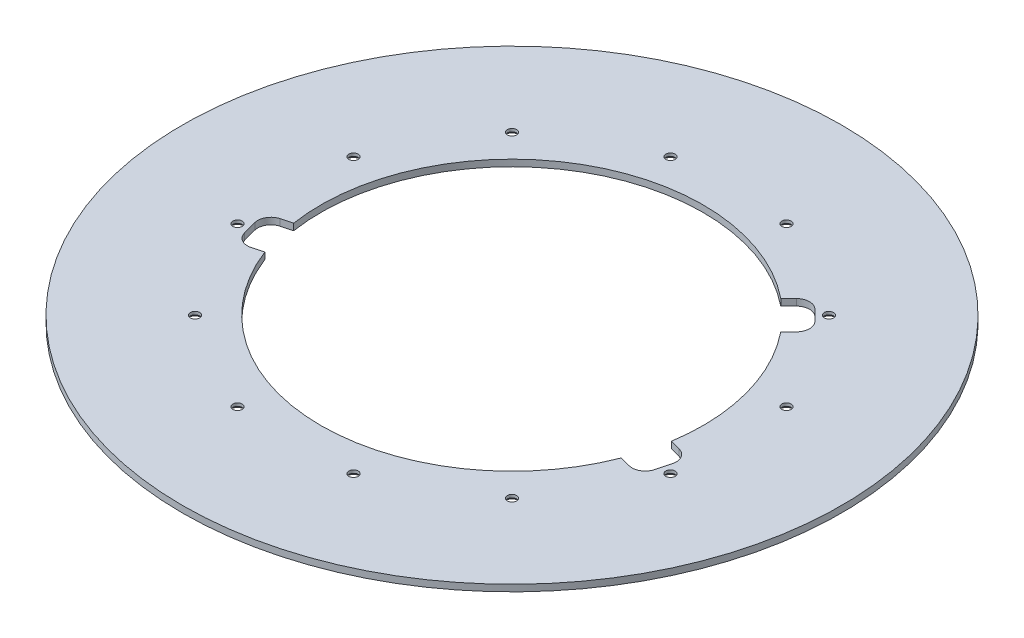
ISO-10303-21;
HEADER;
FILE_DESCRIPTION(('STEP AP214'),'2;1');
FILE_NAME('part.step','',(''),(''),'','','');
FILE_SCHEMA(('AUTOMOTIVE_DESIGN { 1 0 10303 214 1 1 1 1 }'));
ENDSEC;
DATA;
#1=APPLICATION_CONTEXT('core data for automotive mechanical design processes');
#2=APPLICATION_PROTOCOL_DEFINITION('international standard','automotive_design',2000,#1);
#3=PRODUCT_CONTEXT('',#1,'mechanical');
#4=PRODUCT('Part','Part','',(#3));
#5=PRODUCT_RELATED_PRODUCT_CATEGORY('part','',(#4));
#6=PRODUCT_DEFINITION_FORMATION('','',#4);
#7=PRODUCT_DEFINITION_CONTEXT('part definition',#1,'design');
#8=PRODUCT_DEFINITION('design','',#6,#7);
#9=PRODUCT_DEFINITION_SHAPE('','',#8);
#10=(LENGTH_UNIT() NAMED_UNIT(*) SI_UNIT(.MILLI.,.METRE.));
#11=(NAMED_UNIT(*) PLANE_ANGLE_UNIT() SI_UNIT($,.RADIAN.));
#12=(NAMED_UNIT(*) SI_UNIT($,.STERADIAN.) SOLID_ANGLE_UNIT());
#13=UNCERTAINTY_MEASURE_WITH_UNIT(LENGTH_MEASURE(1.E-05),#10,'distance_accuracy_value','');
#14=(GEOMETRIC_REPRESENTATION_CONTEXT(3) GLOBAL_UNCERTAINTY_ASSIGNED_CONTEXT((#13)) GLOBAL_UNIT_ASSIGNED_CONTEXT((#10,
#11,#12)) REPRESENTATION_CONTEXT('',''));
#15=CARTESIAN_POINT('',(0.,0.,0.));
#16=DIRECTION('',(0.,0.,1.));
#17=DIRECTION('',(1.,0.,0.));
#18=AXIS2_PLACEMENT_3D('',#15,#16,#17);
#19=CARTESIAN_POINT('',(0.,0.,0.));
#20=DIRECTION('',(0.,1.,0.));
#21=DIRECTION('',(0.,0.,1.));
#22=AXIS2_PLACEMENT_3D('',#19,#20,#21);
#23=CYLINDRICAL_SURFACE('',#22,92.075);
#24=CARTESIAN_POINT('',(0.,0.,0.));
#25=DIRECTION('',(0.,1.,0.));
#26=DIRECTION('',(0.,0.,1.));
#27=AXIS2_PLACEMENT_3D('',#24,#25,#26);
#28=CIRCLE('',#27,92.075);
#29=CARTESIAN_POINT('',(90.9754475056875,0.,14.1870918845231));
#30=VERTEX_POINT('',#29);
#31=CARTESIAN_POINT('',(71.6935027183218,0.,-57.7741057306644));
#32=VERTEX_POINT('',#31);
#33=EDGE_CURVE('E188',#30,#32,#28,.T.);
#34=ORIENTED_EDGE('',*,*,#33,.F.);
#35=DIRECTION('',(0.,1.,0.));
#36=VECTOR('',#35,1.);
#37=CARTESIAN_POINT('',(90.9754475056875,0.,14.1870918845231));
#38=LINE('',#37,#36);
#39=CARTESIAN_POINT('',(90.9754475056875,3.175,14.1870918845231));
#40=VERTEX_POINT('',#39);
#41=EDGE_CURVE('E11',#30,#40,#38,.T.);
#42=ORIENTED_EDGE('',*,*,#41,.T.);
#43=CARTESIAN_POINT('',(0.,3.175,0.));
#44=DIRECTION('',(0.,1.,0.));
#45=DIRECTION('',(0.,0.,1.));
#46=AXIS2_PLACEMENT_3D('',#43,#44,#45);
#47=CIRCLE('',#46,92.075);
#48=CARTESIAN_POINT('',(71.6935027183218,3.175,-57.7741057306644));
#49=VERTEX_POINT('',#48);
#50=EDGE_CURVE('E400',#40,#49,#47,.T.);
#51=ORIENTED_EDGE('',*,*,#50,.T.);
#52=DIRECTION('',(0.,1.,0.));
#53=VECTOR('',#52,1.);
#54=CARTESIAN_POINT('',(71.6935027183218,0.,-57.7741057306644));
#55=LINE('',#54,#53);
#56=EDGE_CURVE('E412',#49,#32,#55,.F.);
#57=ORIENTED_EDGE('',*,*,#56,.T.);
#58=EDGE_LOOP('',(#34,#42,#51,#57));
#59=FACE_BOUND('',#58,.T.);
#60=ADVANCED_FACE('F40',(#59),#23,.F.);
#61=CARTESIAN_POINT('',(57.7741057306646,0.,-71.6935027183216));
#62=VERTEX_POINT('',#61);
#63=CARTESIAN_POINT('',(-90.9754475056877,0.,14.1870918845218));
#64=VERTEX_POINT('',#63);
#65=EDGE_CURVE('E396',#62,#64,#28,.T.);
#66=ORIENTED_EDGE('',*,*,#65,.F.);
#67=DIRECTION('',(0.,1.,0.));
#68=VECTOR('',#67,1.);
#69=CARTESIAN_POINT('',(57.7741057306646,0.,-71.6935027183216));
#70=LINE('',#69,#68);
#71=CARTESIAN_POINT('',(57.7741057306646,3.175,-71.6935027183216));
#72=VERTEX_POINT('',#71);
#73=EDGE_CURVE('E414',#62,#72,#70,.T.);
#74=ORIENTED_EDGE('',*,*,#73,.T.);
#75=CARTESIAN_POINT('',(-90.9754475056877,3.175,14.1870918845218));
#76=VERTEX_POINT('',#75);
#77=EDGE_CURVE('E391',#72,#76,#47,.T.);
#78=ORIENTED_EDGE('',*,*,#77,.T.);
#79=DIRECTION('',(0.,1.,0.));
#80=VECTOR('',#79,1.);
#81=CARTESIAN_POINT('',(-90.9754475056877,0.,14.1870918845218));
#82=LINE('',#81,#80);
#83=EDGE_CURVE('E404',#76,#64,#82,.F.);
#84=ORIENTED_EDGE('',*,*,#83,.T.);
#85=EDGE_LOOP('',(#66,#74,#78,#84));
#86=FACE_BOUND('',#85,.T.);
#87=ADVANCED_FACE('F459',(#86),#23,.F.);
#88=CARTESIAN_POINT('',(0.,3.175,0.));
#89=DIRECTION('',(0.,-1.,0.));
#90=DIRECTION('',(0.,0.,-1.));
#91=AXIS2_PLACEMENT_3D('',#88,#89,#90);
#92=CYLINDRICAL_SURFACE('',#91,158.75);
#93=CARTESIAN_POINT('',(0.,3.175,0.));
#94=DIRECTION('',(0.,1.,0.));
#95=DIRECTION('',(0.,0.,1.));
#96=AXIS2_PLACEMENT_3D('',#93,#94,#95);
#97=CIRCLE('',#96,158.75);
#98=CARTESIAN_POINT('',(0.,3.175,158.75));
#99=VERTEX_POINT('',#98);
#100=EDGE_CURVE('E401',#99,#99,#97,.T.);
#101=ORIENTED_EDGE('',*,*,#100,.F.);
#102=EDGE_LOOP('',(#101));
#103=FACE_BOUND('',#102,.T.);
#104=CARTESIAN_POINT('',(0.,0.,0.));
#105=DIRECTION('',(0.,1.,0.));
#106=DIRECTION('',(0.,0.,1.));
#107=AXIS2_PLACEMENT_3D('',#104,#105,#106);
#108=CIRCLE('',#107,158.75);
#109=CARTESIAN_POINT('',(0.,0.,158.75));
#110=VERTEX_POINT('',#109);
#111=EDGE_CURVE('E395',#110,#110,#108,.T.);
#112=ORIENTED_EDGE('',*,*,#111,.T.);
#113=EDGE_LOOP('',(#112));
#114=FACE_BOUND('',#113,.T.);
#115=ADVANCED_FACE('F42',(#103,#114),#92,.T.);
#116=CARTESIAN_POINT('',(0.,3.175,0.));
#117=DIRECTION('',(0.,1.,0.));
#118=DIRECTION('',(0.,0.,1.));
#119=AXIS2_PLACEMENT_3D('',#116,#117,#118);
#120=PLANE('',#119);
#121=DIRECTION('',(-0.965925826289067,0.,-0.258819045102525));
#122=VECTOR('',#121,1.);
#123=CARTESIAN_POINT('',(2.54742645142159,3.175,-9.50712494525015));
#124=LINE('',#123,#122);
#125=CARTESIAN_POINT('',(96.0852686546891,3.175,15.5562643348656));
#126=VERTEX_POINT('',#125);
#127=EDGE_CURVE('E216',#126,#40,#124,.T.);
#128=ORIENTED_EDGE('',*,*,#127,.F.);
#129=CARTESIAN_POINT('',(94.4417677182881,3.175,21.6898933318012));
#130=DIRECTION('',(0.,1.,0.));
#131=DIRECTION('',(0.499999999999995,0.,-0.866025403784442));
#132=AXIS2_PLACEMENT_3D('',#129,#130,#131);
#133=CIRCLE('',#132,6.35000000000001);
#134=CARTESIAN_POINT('',(100.575396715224,3.175,23.3333942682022));
#135=VERTEX_POINT('',#134);
#136=EDGE_CURVE('E234',#135,#126,#133,.T.);
#137=ORIENTED_EDGE('',*,*,#136,.F.);
#138=DIRECTION('',(0.258819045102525,0.,-0.965925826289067));
#139=VECTOR('',#138,1.);
#140=CARTESIAN_POINT('',(100.575396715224,3.175,23.3333942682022));
#141=LINE('',#140,#139);
#142=CARTESIAN_POINT('',(98.7675456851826,3.175,30.0803861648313));
#143=VERTEX_POINT('',#142);
#144=EDGE_CURVE('E231',#143,#135,#141,.T.);
#145=ORIENTED_EDGE('',*,*,#144,.F.);
#146=CARTESIAN_POINT('',(92.633916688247,3.175,28.4368852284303));
#147=DIRECTION('',(0.,1.,0.));
#148=DIRECTION('',(-0.499999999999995,0.,0.866025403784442));
#149=AXIS2_PLACEMENT_3D('',#146,#147,#148);
#150=CIRCLE('',#149,6.35);
#151=CARTESIAN_POINT('',(90.9904157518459,3.175,34.5705142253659));
#152=VERTEX_POINT('',#151);
#153=EDGE_CURVE('E228',#152,#143,#150,.T.);
#154=ORIENTED_EDGE('',*,*,#153,.F.);
#155=DIRECTION('',(0.965925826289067,0.,0.258819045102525));
#156=VECTOR('',#155,1.);
#157=CARTESIAN_POINT('',(90.9904157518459,3.175,34.5705142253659));
#158=LINE('',#157,#156);
#159=CARTESIAN_POINT('',(85.8805946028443,3.175,33.2013417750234));
#160=VERTEX_POINT('',#159);
#161=EDGE_CURVE('E210',#160,#152,#158,.T.);
#162=ORIENTED_EDGE('',*,*,#161,.F.);
#163=CARTESIAN_POINT('',(-85.8805946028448,3.175,33.2013417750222));
#164=VERTEX_POINT('',#163);
#165=EDGE_CURVE('E397',#164,#160,#47,.T.);
#166=ORIENTED_EDGE('',*,*,#165,.F.);
#167=DIRECTION('',(0.965925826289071,0.,-0.258819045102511));
#168=VECTOR('',#167,1.);
#169=CARTESIAN_POINT('',(2.54742645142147,3.175,9.50712494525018));
#170=LINE('',#169,#168);
#171=CARTESIAN_POINT('',(-90.9904157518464,3.175,34.5705142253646));
#172=VERTEX_POINT('',#171);
#173=EDGE_CURVE('E251',#172,#164,#170,.T.);
#174=ORIENTED_EDGE('',*,*,#173,.F.);
#175=CARTESIAN_POINT('',(-92.6339166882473,3.175,28.436885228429));
#176=DIRECTION('',(0.,1.,0.));
#177=DIRECTION('',(0.,0.,1.));
#178=AXIS2_PLACEMENT_3D('',#175,#176,#177);
#179=CIRCLE('',#178,6.35000000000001);
#180=CARTESIAN_POINT('',(-98.767545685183,3.175,30.08038616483));
#181=VERTEX_POINT('',#180);
#182=EDGE_CURVE('E271',#181,#172,#179,.T.);
#183=ORIENTED_EDGE('',*,*,#182,.F.);
#184=DIRECTION('',(0.258819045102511,0.,0.965925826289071));
#185=VECTOR('',#184,1.);
#186=CARTESIAN_POINT('',(-98.767545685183,3.175,30.08038616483));
#187=LINE('',#186,#185);
#188=CARTESIAN_POINT('',(-100.575396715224,3.175,23.3333942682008));
#189=VERTEX_POINT('',#188);
#190=EDGE_CURVE('E268',#189,#181,#187,.T.);
#191=ORIENTED_EDGE('',*,*,#190,.F.);
#192=CARTESIAN_POINT('',(-94.4417677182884,3.175,21.6898933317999));
#193=DIRECTION('',(0.,1.,0.));
#194=DIRECTION('',(0.,0.,-1.));
#195=AXIS2_PLACEMENT_3D('',#192,#193,#194);
#196=CIRCLE('',#195,6.35);
#197=CARTESIAN_POINT('',(-96.0852686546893,3.175,15.5562643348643));
#198=VERTEX_POINT('',#197);
#199=EDGE_CURVE('E265',#198,#189,#196,.T.);
#200=ORIENTED_EDGE('',*,*,#199,.F.);
#201=DIRECTION('',(-0.965925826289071,0.,0.258819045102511));
#202=VECTOR('',#201,1.);
#203=CARTESIAN_POINT('',(-96.0852686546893,3.175,15.5562643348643));
#204=LINE('',#203,#202);
#205=EDGE_CURVE('E240',#76,#198,#204,.T.);
#206=ORIENTED_EDGE('',*,*,#205,.F.);
#207=ORIENTED_EDGE('',*,*,#77,.F.);
#208=DIRECTION('',(-0.707106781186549,0.,0.707106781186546));
#209=VECTOR('',#208,1.);
#210=CARTESIAN_POINT('',(-6.95969849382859,3.175,-6.9596984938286));
#211=LINE('',#210,#209);
#212=CARTESIAN_POINT('',(61.5147544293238,3.175,-75.4341514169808));
#213=VERTEX_POINT('',#212);
#214=EDGE_CURVE('E189',#213,#72,#211,.T.);
#215=ORIENTED_EDGE('',*,*,#214,.F.);
#216=CARTESIAN_POINT('',(66.0048824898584,3.175,-70.9440233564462));
#217=DIRECTION('',(0.,1.,0.));
#218=DIRECTION('',(-0.500000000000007,0.,-0.866025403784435));
#219=AXIS2_PLACEMENT_3D('',#216,#217,#218);
#220=CIRCLE('',#219,6.35000000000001);
#221=CARTESIAN_POINT('',(70.495010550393,3.175,-75.4341514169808));
#222=VERTEX_POINT('',#221);
#223=EDGE_CURVE('E191',#222,#213,#220,.T.);
#224=ORIENTED_EDGE('',*,*,#223,.F.);
#225=DIRECTION('',(-0.707106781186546,0.,-0.707106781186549));
#226=VECTOR('',#225,1.);
#227=CARTESIAN_POINT('',(70.495010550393,3.175,-75.4341514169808));
#228=LINE('',#227,#226);
#229=CARTESIAN_POINT('',(75.434151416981,3.175,-70.4950105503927));
#230=VERTEX_POINT('',#229);
#231=EDGE_CURVE('E203',#230,#222,#228,.T.);
#232=ORIENTED_EDGE('',*,*,#231,.F.);
#233=CARTESIAN_POINT('',(70.9440233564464,3.175,-66.0048824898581));
#234=DIRECTION('',(0.,1.,0.));
#235=DIRECTION('',(0.500000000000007,0.,0.866025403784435));
#236=AXIS2_PLACEMENT_3D('',#233,#234,#235);
#237=CIRCLE('',#236,6.35);
#238=CARTESIAN_POINT('',(75.434151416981,3.175,-61.5147544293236));
#239=VERTEX_POINT('',#238);
#240=EDGE_CURVE('E201',#239,#230,#237,.T.);
#241=ORIENTED_EDGE('',*,*,#240,.F.);
#242=DIRECTION('',(0.707106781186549,0.,-0.707106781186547));
#243=VECTOR('',#242,1.);
#244=CARTESIAN_POINT('',(75.434151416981,3.175,-61.5147544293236));
#245=LINE('',#244,#243);
#246=EDGE_CURVE('E167',#49,#239,#245,.T.);
#247=ORIENTED_EDGE('',*,*,#246,.F.);
#248=ORIENTED_EDGE('',*,*,#50,.F.);
#249=EDGE_LOOP('',(#128,#137,#145,#154,#162,#166,#174,#183,#191,#200,#206,#207,#215,#224,#232,
#241,#247,#248));
#250=FACE_BOUND('',#249,.T.);
#251=CARTESIAN_POINT('',(-76.3321770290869,3.175,-76.3321770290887));
#252=DIRECTION('',(0.,-1.,0.));
#253=DIRECTION('',(0.,0.,-1.));
#254=AXIS2_PLACEMENT_3D('',#251,#252,#253);
#255=CIRCLE('',#254,2.25);
#256=CARTESIAN_POINT('',(-76.3321770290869,3.175,-78.5821770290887));
#257=VERTEX_POINT('',#256);
#258=EDGE_CURVE('E289',#257,#257,#255,.T.);
#259=ORIENTED_EDGE('',*,*,#258,.T.);
#260=EDGE_LOOP('',(#259));
#261=FACE_BOUND('',#260,.T.);
#262=CARTESIAN_POINT('',(-104.271692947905,3.175,-27.9395159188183));
#263=DIRECTION('',(0.,-1.,0.));
#264=DIRECTION('',(0.,0.,-1.));
#265=AXIS2_PLACEMENT_3D('',#262,#263,#264);
#266=CIRCLE('',#265,2.25);
#267=CARTESIAN_POINT('',(-104.271692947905,3.175,-30.1895159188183));
#268=VERTEX_POINT('',#267);
#269=EDGE_CURVE('E298',#268,#268,#266,.T.);
#270=ORIENTED_EDGE('',*,*,#269,.T.);
#271=EDGE_LOOP('',(#270));
#272=FACE_BOUND('',#271,.T.);
#273=CARTESIAN_POINT('',(-104.271692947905,3.175,27.9395159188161));
#274=DIRECTION('',(0.,-1.,0.));
#275=DIRECTION('',(0.,0.,-1.));
#276=AXIS2_PLACEMENT_3D('',#273,#274,#275);
#277=CIRCLE('',#276,2.25);
#278=CARTESIAN_POINT('',(-104.271692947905,3.175,25.6895159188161));
#279=VERTEX_POINT('',#278);
#280=EDGE_CURVE('E307',#279,#279,#277,.T.);
#281=ORIENTED_EDGE('',*,*,#280,.T.);
#282=EDGE_LOOP('',(#281));
#283=FACE_BOUND('',#282,.T.);
#284=CARTESIAN_POINT('',(-76.3321770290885,3.175,76.3321770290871));
#285=DIRECTION('',(0.,-1.,0.));
#286=DIRECTION('',(0.,0.,-1.));
#287=AXIS2_PLACEMENT_3D('',#284,#285,#286);
#288=CIRCLE('',#287,2.25);
#289=CARTESIAN_POINT('',(-76.3321770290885,3.175,74.0821770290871));
#290=VERTEX_POINT('',#289);
#291=EDGE_CURVE('E316',#290,#290,#288,.T.);
#292=ORIENTED_EDGE('',*,*,#291,.T.);
#293=EDGE_LOOP('',(#292));
#294=FACE_BOUND('',#293,.T.);
#295=CARTESIAN_POINT('',(-27.9395159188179,3.175,104.271692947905));
#296=DIRECTION('',(0.,-1.,0.));
#297=DIRECTION('',(0.,0.,-1.));
#298=AXIS2_PLACEMENT_3D('',#295,#296,#297);
#299=CIRCLE('',#298,2.25);
#300=CARTESIAN_POINT('',(-27.9395159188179,3.175,102.021692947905));
#301=VERTEX_POINT('',#300);
#302=EDGE_CURVE('E325',#301,#301,#299,.T.);
#303=ORIENTED_EDGE('',*,*,#302,.T.);
#304=EDGE_LOOP('',(#303));
#305=FACE_BOUND('',#304,.T.);
#306=CARTESIAN_POINT('',(27.9395159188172,3.175,104.271692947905));
#307=DIRECTION('',(0.,-1.,0.));
#308=DIRECTION('',(0.,0.,-1.));
#309=AXIS2_PLACEMENT_3D('',#306,#307,#308);
#310=CIRCLE('',#309,2.25);
#311=CARTESIAN_POINT('',(27.9395159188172,3.175,102.021692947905));
#312=VERTEX_POINT('',#311);
#313=EDGE_CURVE('E334',#312,#312,#310,.T.);
#314=ORIENTED_EDGE('',*,*,#313,.T.);
#315=EDGE_LOOP('',(#314));
#316=FACE_BOUND('',#315,.T.);
#317=CARTESIAN_POINT('',(76.3321770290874,3.175,76.3321770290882));
#318=DIRECTION('',(0.,-1.,0.));
#319=DIRECTION('',(0.,0.,-1.));
#320=AXIS2_PLACEMENT_3D('',#317,#318,#319);
#321=CIRCLE('',#320,2.25);
#322=CARTESIAN_POINT('',(76.3321770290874,3.175,74.0821770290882));
#323=VERTEX_POINT('',#322);
#324=EDGE_CURVE('E343',#323,#323,#321,.T.);
#325=ORIENTED_EDGE('',*,*,#324,.T.);
#326=EDGE_LOOP('',(#325));
#327=FACE_BOUND('',#326,.T.);
#328=CARTESIAN_POINT('',(104.271692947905,3.175,27.9395159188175));
#329=DIRECTION('',(0.,-1.,0.));
#330=DIRECTION('',(0.,0.,-1.));
#331=AXIS2_PLACEMENT_3D('',#328,#329,#330);
#332=CIRCLE('',#331,2.25);
#333=CARTESIAN_POINT('',(104.271692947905,3.175,25.6895159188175));
#334=VERTEX_POINT('',#333);
#335=EDGE_CURVE('E352',#334,#334,#332,.T.);
#336=ORIENTED_EDGE('',*,*,#335,.T.);
#337=EDGE_LOOP('',(#336));
#338=FACE_BOUND('',#337,.T.);
#339=CARTESIAN_POINT('',(104.271692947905,3.175,-27.9395159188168));
#340=DIRECTION('',(0.,-1.,0.));
#341=DIRECTION('',(0.,0.,-1.));
#342=AXIS2_PLACEMENT_3D('',#339,#340,#341);
#343=CIRCLE('',#342,2.25);
#344=CARTESIAN_POINT('',(104.271692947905,3.175,-30.1895159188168));
#345=VERTEX_POINT('',#344);
#346=EDGE_CURVE('E361',#345,#345,#343,.T.);
#347=ORIENTED_EDGE('',*,*,#346,.T.);
#348=EDGE_LOOP('',(#347));
#349=FACE_BOUND('',#348,.T.);
#350=CARTESIAN_POINT('',(76.3321770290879,3.175,-76.3321770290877));
#351=DIRECTION('',(0.,-1.,0.));
#352=DIRECTION('',(0.,0.,-1.));
#353=AXIS2_PLACEMENT_3D('',#350,#351,#352);
#354=CIRCLE('',#353,2.25);
#355=CARTESIAN_POINT('',(76.3321770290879,3.175,-78.5821770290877));
#356=VERTEX_POINT('',#355);
#357=EDGE_CURVE('E370',#356,#356,#354,.T.);
#358=ORIENTED_EDGE('',*,*,#357,.T.);
#359=EDGE_LOOP('',(#358));
#360=FACE_BOUND('',#359,.T.);
#361=CARTESIAN_POINT('',(27.9395159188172,3.175,-104.271692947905));
#362=DIRECTION('',(0.,-1.,0.));
#363=DIRECTION('',(0.,0.,-1.));
#364=AXIS2_PLACEMENT_3D('',#361,#362,#363);
#365=CIRCLE('',#364,2.25);
#366=CARTESIAN_POINT('',(27.9395159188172,3.175,-106.521692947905));
#367=VERTEX_POINT('',#366);
#368=EDGE_CURVE('E379',#367,#367,#365,.T.);
#369=ORIENTED_EDGE('',*,*,#368,.T.);
#370=EDGE_LOOP('',(#369));
#371=FACE_BOUND('',#370,.T.);
#372=CARTESIAN_POINT('',(-27.9395159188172,3.175,-104.271692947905));
#373=DIRECTION('',(0.,-1.,0.));
#374=DIRECTION('',(0.,0.,-1.));
#375=AXIS2_PLACEMENT_3D('',#372,#373,#374);
#376=CIRCLE('',#375,2.25);
#377=CARTESIAN_POINT('',(-27.9395159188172,3.175,-106.521692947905));
#378=VERTEX_POINT('',#377);
#379=EDGE_CURVE('E388',#378,#378,#376,.T.);
#380=ORIENTED_EDGE('',*,*,#379,.T.);
#381=EDGE_LOOP('',(#380));
#382=FACE_BOUND('',#381,.T.);
#383=ORIENTED_EDGE('',*,*,#100,.T.);
#384=EDGE_LOOP('',(#383));
#385=FACE_BOUND('',#384,.T.);
#386=ADVANCED_FACE('F428',(#250,#261,#272,#283,#294,#305,#316,#327,#338,#349,#360,#371,#382,
#385),#120,.T.);
#387=CARTESIAN_POINT('',(0.,0.,0.));
#388=DIRECTION('',(0.,1.,0.));
#389=DIRECTION('',(0.,0.,1.));
#390=AXIS2_PLACEMENT_3D('',#387,#388,#389);
#391=PLANE('',#390);
#392=CARTESIAN_POINT('',(-76.3321770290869,0.,-76.3321770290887));
#393=DIRECTION('',(0.,-1.,0.));
#394=DIRECTION('',(0.,0.,-1.));
#395=AXIS2_PLACEMENT_3D('',#392,#393,#394);
#396=CIRCLE('',#395,4.0005);
#397=CARTESIAN_POINT('',(-76.3321770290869,0.,-80.3326770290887));
#398=VERTEX_POINT('',#397);
#399=EDGE_CURVE('E277',#398,#398,#396,.T.);
#400=ORIENTED_EDGE('',*,*,#399,.F.);
#401=EDGE_LOOP('',(#400));
#402=FACE_BOUND('',#401,.T.);
#403=CARTESIAN_POINT('',(-104.271692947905,0.,-27.9395159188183));
#404=DIRECTION('',(0.,-1.,0.));
#405=DIRECTION('',(0.,0.,-1.));
#406=AXIS2_PLACEMENT_3D('',#403,#404,#405);
#407=CIRCLE('',#406,4.0005);
#408=CARTESIAN_POINT('',(-104.271692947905,0.,-31.9400159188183));
#409=VERTEX_POINT('',#408);
#410=EDGE_CURVE('E292',#409,#409,#407,.T.);
#411=ORIENTED_EDGE('',*,*,#410,.F.);
#412=EDGE_LOOP('',(#411));
#413=FACE_BOUND('',#412,.T.);
#414=CARTESIAN_POINT('',(-104.271692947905,0.,27.9395159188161));
#415=DIRECTION('',(0.,-1.,0.));
#416=DIRECTION('',(0.,0.,-1.));
#417=AXIS2_PLACEMENT_3D('',#414,#415,#416);
#418=CIRCLE('',#417,4.0005);
#419=CARTESIAN_POINT('',(-104.271692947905,0.,23.9390159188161));
#420=VERTEX_POINT('',#419);
#421=EDGE_CURVE('E301',#420,#420,#418,.T.);
#422=ORIENTED_EDGE('',*,*,#421,.F.);
#423=EDGE_LOOP('',(#422));
#424=FACE_BOUND('',#423,.T.);
#425=CARTESIAN_POINT('',(-76.3321770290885,0.,76.3321770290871));
#426=DIRECTION('',(0.,-1.,0.));
#427=DIRECTION('',(0.,0.,-1.));
#428=AXIS2_PLACEMENT_3D('',#425,#426,#427);
#429=CIRCLE('',#428,4.0005);
#430=CARTESIAN_POINT('',(-76.3321770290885,0.,72.3316770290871));
#431=VERTEX_POINT('',#430);
#432=EDGE_CURVE('E310',#431,#431,#429,.T.);
#433=ORIENTED_EDGE('',*,*,#432,.F.);
#434=EDGE_LOOP('',(#433));
#435=FACE_BOUND('',#434,.T.);
#436=CARTESIAN_POINT('',(-27.9395159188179,0.,104.271692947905));
#437=DIRECTION('',(0.,-1.,0.));
#438=DIRECTION('',(0.,0.,-1.));
#439=AXIS2_PLACEMENT_3D('',#436,#437,#438);
#440=CIRCLE('',#439,4.0005);
#441=CARTESIAN_POINT('',(-27.9395159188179,0.,100.271192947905));
#442=VERTEX_POINT('',#441);
#443=EDGE_CURVE('E319',#442,#442,#440,.T.);
#444=ORIENTED_EDGE('',*,*,#443,.F.);
#445=EDGE_LOOP('',(#444));
#446=FACE_BOUND('',#445,.T.);
#447=CARTESIAN_POINT('',(27.9395159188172,0.,104.271692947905));
#448=DIRECTION('',(0.,-1.,0.));
#449=DIRECTION('',(0.,0.,-1.));
#450=AXIS2_PLACEMENT_3D('',#447,#448,#449);
#451=CIRCLE('',#450,4.0005);
#452=CARTESIAN_POINT('',(27.9395159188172,0.,100.271192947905));
#453=VERTEX_POINT('',#452);
#454=EDGE_CURVE('E328',#453,#453,#451,.T.);
#455=ORIENTED_EDGE('',*,*,#454,.F.);
#456=EDGE_LOOP('',(#455));
#457=FACE_BOUND('',#456,.T.);
#458=CARTESIAN_POINT('',(76.3321770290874,0.,76.3321770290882));
#459=DIRECTION('',(0.,-1.,0.));
#460=DIRECTION('',(0.,0.,-1.));
#461=AXIS2_PLACEMENT_3D('',#458,#459,#460);
#462=CIRCLE('',#461,4.0005);
#463=CARTESIAN_POINT('',(76.3321770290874,0.,72.3316770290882));
#464=VERTEX_POINT('',#463);
#465=EDGE_CURVE('E337',#464,#464,#462,.T.);
#466=ORIENTED_EDGE('',*,*,#465,.F.);
#467=EDGE_LOOP('',(#466));
#468=FACE_BOUND('',#467,.T.);
#469=CARTESIAN_POINT('',(104.271692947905,0.,27.9395159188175));
#470=DIRECTION('',(0.,-1.,0.));
#471=DIRECTION('',(0.,0.,-1.));
#472=AXIS2_PLACEMENT_3D('',#469,#470,#471);
#473=CIRCLE('',#472,4.0005);
#474=CARTESIAN_POINT('',(104.271692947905,0.,23.9390159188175));
#475=VERTEX_POINT('',#474);
#476=EDGE_CURVE('E346',#475,#475,#473,.T.);
#477=ORIENTED_EDGE('',*,*,#476,.F.);
#478=EDGE_LOOP('',(#477));
#479=FACE_BOUND('',#478,.T.);
#480=CARTESIAN_POINT('',(104.271692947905,0.,-27.9395159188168));
#481=DIRECTION('',(0.,-1.,0.));
#482=DIRECTION('',(0.,0.,-1.));
#483=AXIS2_PLACEMENT_3D('',#480,#481,#482);
#484=CIRCLE('',#483,4.0005);
#485=CARTESIAN_POINT('',(104.271692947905,0.,-31.9400159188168));
#486=VERTEX_POINT('',#485);
#487=EDGE_CURVE('E355',#486,#486,#484,.T.);
#488=ORIENTED_EDGE('',*,*,#487,.F.);
#489=EDGE_LOOP('',(#488));
#490=FACE_BOUND('',#489,.T.);
#491=CARTESIAN_POINT('',(76.3321770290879,0.,-76.3321770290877));
#492=DIRECTION('',(0.,-1.,0.));
#493=DIRECTION('',(0.,0.,-1.));
#494=AXIS2_PLACEMENT_3D('',#491,#492,#493);
#495=CIRCLE('',#494,4.0005);
#496=CARTESIAN_POINT('',(76.3321770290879,0.,-80.3326770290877));
#497=VERTEX_POINT('',#496);
#498=EDGE_CURVE('E364',#497,#497,#495,.T.);
#499=ORIENTED_EDGE('',*,*,#498,.F.);
#500=EDGE_LOOP('',(#499));
#501=FACE_BOUND('',#500,.T.);
#502=CARTESIAN_POINT('',(27.9395159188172,0.,-104.271692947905));
#503=DIRECTION('',(0.,-1.,0.));
#504=DIRECTION('',(0.,0.,-1.));
#505=AXIS2_PLACEMENT_3D('',#502,#503,#504);
#506=CIRCLE('',#505,4.0005);
#507=CARTESIAN_POINT('',(27.9395159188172,0.,-108.272192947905));
#508=VERTEX_POINT('',#507);
#509=EDGE_CURVE('E373',#508,#508,#506,.T.);
#510=ORIENTED_EDGE('',*,*,#509,.F.);
#511=EDGE_LOOP('',(#510));
#512=FACE_BOUND('',#511,.T.);
#513=CARTESIAN_POINT('',(-27.9395159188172,0.,-104.271692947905));
#514=DIRECTION('',(0.,-1.,0.));
#515=DIRECTION('',(0.,0.,-1.));
#516=AXIS2_PLACEMENT_3D('',#513,#514,#515);
#517=CIRCLE('',#516,4.0005);
#518=CARTESIAN_POINT('',(-27.9395159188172,0.,-108.272192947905));
#519=VERTEX_POINT('',#518);
#520=EDGE_CURVE('E382',#519,#519,#517,.T.);
#521=ORIENTED_EDGE('',*,*,#520,.F.);
#522=EDGE_LOOP('',(#521));
#523=FACE_BOUND('',#522,.T.);
#524=CARTESIAN_POINT('',(94.4417677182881,0.,21.6898933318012));
#525=DIRECTION('',(0.,1.,0.));
#526=DIRECTION('',(0.499999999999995,0.,-0.866025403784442));
#527=AXIS2_PLACEMENT_3D('',#524,#525,#526);
#528=CIRCLE('',#527,6.35000000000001);
#529=CARTESIAN_POINT('',(100.575396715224,0.,23.3333942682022));
#530=VERTEX_POINT('',#529);
#531=CARTESIAN_POINT('',(96.0852686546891,0.,15.5562643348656));
#532=VERTEX_POINT('',#531);
#533=EDGE_CURVE('E222',#530,#532,#528,.T.);
#534=ORIENTED_EDGE('',*,*,#533,.T.);
#535=DIRECTION('',(-0.965925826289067,0.,-0.258819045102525));
#536=VECTOR('',#535,1.);
#537=CARTESIAN_POINT('',(2.54742645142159,0.,-9.50712494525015));
#538=LINE('',#537,#536);
#539=EDGE_CURVE('E224',#532,#30,#538,.T.);
#540=ORIENTED_EDGE('',*,*,#539,.T.);
#541=ORIENTED_EDGE('',*,*,#33,.T.);
#542=DIRECTION('',(0.707106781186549,0.,-0.707106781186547));
#543=VECTOR('',#542,1.);
#544=CARTESIAN_POINT('',(75.434151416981,0.,-61.5147544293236));
#545=LINE('',#544,#543);
#546=CARTESIAN_POINT('',(75.434151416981,0.,-61.5147544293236));
#547=VERTEX_POINT('',#546);
#548=EDGE_CURVE('E55',#32,#547,#545,.T.);
#549=ORIENTED_EDGE('',*,*,#548,.T.);
#550=CARTESIAN_POINT('',(70.9440233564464,0.,-66.0048824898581));
#551=DIRECTION('',(0.,1.,0.));
#552=DIRECTION('',(0.500000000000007,0.,0.866025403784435));
#553=AXIS2_PLACEMENT_3D('',#550,#551,#552);
#554=CIRCLE('',#553,6.35);
#555=CARTESIAN_POINT('',(75.434151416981,0.,-70.4950105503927));
#556=VERTEX_POINT('',#555);
#557=EDGE_CURVE('E175',#547,#556,#554,.T.);
#558=ORIENTED_EDGE('',*,*,#557,.T.);
#559=DIRECTION('',(-0.707106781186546,0.,-0.707106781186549));
#560=VECTOR('',#559,1.);
#561=CARTESIAN_POINT('',(70.495010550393,0.,-75.4341514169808));
#562=LINE('',#561,#560);
#563=CARTESIAN_POINT('',(70.495010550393,0.,-75.4341514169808));
#564=VERTEX_POINT('',#563);
#565=EDGE_CURVE('E180',#556,#564,#562,.T.);
#566=ORIENTED_EDGE('',*,*,#565,.T.);
#567=CARTESIAN_POINT('',(66.0048824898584,0.,-70.9440233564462));
#568=DIRECTION('',(0.,1.,0.));
#569=DIRECTION('',(-0.500000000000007,0.,-0.866025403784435));
#570=AXIS2_PLACEMENT_3D('',#567,#568,#569);
#571=CIRCLE('',#570,6.35000000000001);
#572=CARTESIAN_POINT('',(61.5147544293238,0.,-75.4341514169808));
#573=VERTEX_POINT('',#572);
#574=EDGE_CURVE('E195',#564,#573,#571,.T.);
#575=ORIENTED_EDGE('',*,*,#574,.T.);
#576=DIRECTION('',(-0.707106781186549,0.,0.707106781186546));
#577=VECTOR('',#576,1.);
#578=CARTESIAN_POINT('',(-6.95969849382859,0.,-6.9596984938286));
#579=LINE('',#578,#577);
#580=EDGE_CURVE('E172',#573,#62,#579,.T.);
#581=ORIENTED_EDGE('',*,*,#580,.T.);
#582=ORIENTED_EDGE('',*,*,#65,.T.);
#583=DIRECTION('',(-0.965925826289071,0.,0.258819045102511));
#584=VECTOR('',#583,1.);
#585=CARTESIAN_POINT('',(-96.0852686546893,0.,15.5562643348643));
#586=LINE('',#585,#584);
#587=CARTESIAN_POINT('',(-96.0852686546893,0.,15.5562643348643));
#588=VERTEX_POINT('',#587);
#589=EDGE_CURVE('E247',#64,#588,#586,.T.);
#590=ORIENTED_EDGE('',*,*,#589,.T.);
#591=CARTESIAN_POINT('',(-94.4417677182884,0.,21.6898933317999));
#592=DIRECTION('',(0.,1.,0.));
#593=DIRECTION('',(0.,0.,-1.));
#594=AXIS2_PLACEMENT_3D('',#591,#592,#593);
#595=CIRCLE('',#594,6.35);
#596=CARTESIAN_POINT('',(-100.575396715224,0.,23.3333942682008));
#597=VERTEX_POINT('',#596);
#598=EDGE_CURVE('E250',#588,#597,#595,.T.);
#599=ORIENTED_EDGE('',*,*,#598,.T.);
#600=DIRECTION('',(0.258819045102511,0.,0.965925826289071));
#601=VECTOR('',#600,1.);
#602=CARTESIAN_POINT('',(-98.767545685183,0.,30.08038616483));
#603=LINE('',#602,#601);
#604=CARTESIAN_POINT('',(-98.767545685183,0.,30.08038616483));
#605=VERTEX_POINT('',#604);
#606=EDGE_CURVE('E254',#597,#605,#603,.T.);
#607=ORIENTED_EDGE('',*,*,#606,.T.);
#608=CARTESIAN_POINT('',(-92.6339166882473,0.,28.436885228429));
#609=DIRECTION('',(0.,1.,0.));
#610=DIRECTION('',(0.,0.,1.));
#611=AXIS2_PLACEMENT_3D('',#608,#609,#610);
#612=CIRCLE('',#611,6.35000000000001);
#613=CARTESIAN_POINT('',(-90.9904157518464,0.,34.5705142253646));
#614=VERTEX_POINT('',#613);
#615=EDGE_CURVE('E257',#605,#614,#612,.T.);
#616=ORIENTED_EDGE('',*,*,#615,.T.);
#617=DIRECTION('',(0.965925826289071,0.,-0.258819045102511));
#618=VECTOR('',#617,1.);
#619=CARTESIAN_POINT('',(2.54742645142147,0.,9.50712494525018));
#620=LINE('',#619,#618);
#621=CARTESIAN_POINT('',(-85.8805946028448,0.,33.2013417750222));
#622=VERTEX_POINT('',#621);
#623=EDGE_CURVE('E260',#614,#622,#620,.T.);
#624=ORIENTED_EDGE('',*,*,#623,.T.);
#625=CARTESIAN_POINT('',(85.8805946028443,0.,33.2013417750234));
#626=VERTEX_POINT('',#625);
#627=EDGE_CURVE('E392',#622,#626,#28,.T.);
#628=ORIENTED_EDGE('',*,*,#627,.T.);
#629=DIRECTION('',(0.965925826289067,0.,0.258819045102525));
#630=VECTOR('',#629,1.);
#631=CARTESIAN_POINT('',(90.9904157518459,0.,34.5705142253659));
#632=LINE('',#631,#630);
#633=CARTESIAN_POINT('',(90.9904157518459,0.,34.5705142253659));
#634=VERTEX_POINT('',#633);
#635=EDGE_CURVE('E63',#626,#634,#632,.T.);
#636=ORIENTED_EDGE('',*,*,#635,.T.);
#637=CARTESIAN_POINT('',(92.633916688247,0.,28.4368852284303));
#638=DIRECTION('',(0.,1.,0.));
#639=DIRECTION('',(-0.499999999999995,0.,0.866025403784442));
#640=AXIS2_PLACEMENT_3D('',#637,#638,#639);
#641=CIRCLE('',#640,6.35);
#642=CARTESIAN_POINT('',(98.7675456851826,0.,30.0803861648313));
#643=VERTEX_POINT('',#642);
#644=EDGE_CURVE('E215',#634,#643,#641,.T.);
#645=ORIENTED_EDGE('',*,*,#644,.T.);
#646=DIRECTION('',(0.258819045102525,0.,-0.965925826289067));
#647=VECTOR('',#646,1.);
#648=CARTESIAN_POINT('',(100.575396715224,0.,23.3333942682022));
#649=LINE('',#648,#647);
#650=EDGE_CURVE('E219',#643,#530,#649,.T.);
#651=ORIENTED_EDGE('',*,*,#650,.T.);
#652=EDGE_LOOP('',(#534,#540,#541,#549,#558,#566,#575,#581,#582,#590,#599,#607,#616,#624,#628,
#636,#645,#651));
#653=FACE_BOUND('',#652,.T.);
#654=ORIENTED_EDGE('',*,*,#111,.F.);
#655=EDGE_LOOP('',(#654));
#656=FACE_BOUND('',#655,.T.);
#657=ADVANCED_FACE('F184',(#402,#413,#424,#435,#446,#457,#468,#479,#490,#501,#512,#523,#653,
#656),#391,.F.);
#658=ORIENTED_EDGE('',*,*,#165,.T.);
#659=DIRECTION('',(0.,1.,0.));
#660=VECTOR('',#659,1.);
#661=CARTESIAN_POINT('',(85.8805946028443,0.,33.2013417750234));
#662=LINE('',#661,#660);
#663=EDGE_CURVE('E48',#160,#626,#662,.F.);
#664=ORIENTED_EDGE('',*,*,#663,.T.);
#665=ORIENTED_EDGE('',*,*,#627,.F.);
#666=DIRECTION('',(0.,1.,0.));
#667=VECTOR('',#666,1.);
#668=CARTESIAN_POINT('',(-85.8805946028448,0.,33.2013417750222));
#669=LINE('',#668,#667);
#670=EDGE_CURVE('E409',#622,#164,#669,.T.);
#671=ORIENTED_EDGE('',*,*,#670,.T.);
#672=EDGE_LOOP('',(#658,#664,#665,#671));
#673=FACE_BOUND('',#672,.T.);
#674=ADVANCED_FACE('F418',(#673),#23,.F.);
#675=CARTESIAN_POINT('',(-27.9395159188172,0.,-104.271692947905));
#676=DIRECTION('',(0.,-1.,0.));
#677=DIRECTION('',(0.,0.,-1.));
#678=AXIS2_PLACEMENT_3D('',#675,#676,#677);
#679=CYLINDRICAL_SURFACE('',#678,2.25);
#680=ORIENTED_EDGE('',*,*,#379,.F.);
#681=EDGE_LOOP('',(#680));
#682=FACE_BOUND('',#681,.T.);
#683=CARTESIAN_POINT('',(-27.9395159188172,1.7505,-104.271692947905));
#684=DIRECTION('',(0.,-1.,0.));
#685=DIRECTION('',(0.,0.,-1.));
#686=AXIS2_PLACEMENT_3D('',#683,#684,#685);
#687=CIRCLE('',#686,2.25);
#688=CARTESIAN_POINT('',(-27.9395159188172,1.7505,-106.521692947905));
#689=VERTEX_POINT('',#688);
#690=EDGE_CURVE('E385',#689,#689,#687,.T.);
#691=ORIENTED_EDGE('',*,*,#690,.T.);
#692=EDGE_LOOP('',(#691));
#693=FACE_BOUND('',#692,.T.);
#694=ADVANCED_FACE('F493',(#682,#693),#679,.F.);
#695=CARTESIAN_POINT('',(-27.9395159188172,0.,-104.271692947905));
#696=DIRECTION('',(0.,-1.,0.));
#697=DIRECTION('',(0.,0.,-1.));
#698=AXIS2_PLACEMENT_3D('',#695,#696,#697);
#699=CONICAL_SURFACE('',#698,4.0005,0.785398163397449);
#700=ORIENTED_EDGE('',*,*,#690,.F.);
#701=EDGE_LOOP('',(#700));
#702=FACE_BOUND('',#701,.T.);
#703=ORIENTED_EDGE('',*,*,#520,.T.);
#704=EDGE_LOOP('',(#703));
#705=FACE_BOUND('',#704,.T.);
#706=ADVANCED_FACE('F498',(#702,#705),#699,.F.);
#707=CARTESIAN_POINT('',(27.9395159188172,0.,-104.271692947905));
#708=DIRECTION('',(0.,-1.,0.));
#709=DIRECTION('',(0.,0.,-1.));
#710=AXIS2_PLACEMENT_3D('',#707,#708,#709);
#711=CYLINDRICAL_SURFACE('',#710,2.25);
#712=ORIENTED_EDGE('',*,*,#368,.F.);
#713=EDGE_LOOP('',(#712));
#714=FACE_BOUND('',#713,.T.);
#715=CARTESIAN_POINT('',(27.9395159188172,1.7505,-104.271692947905));
#716=DIRECTION('',(0.,-1.,0.));
#717=DIRECTION('',(0.,0.,-1.));
#718=AXIS2_PLACEMENT_3D('',#715,#716,#717);
#719=CIRCLE('',#718,2.25);
#720=CARTESIAN_POINT('',(27.9395159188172,1.7505,-106.521692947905));
#721=VERTEX_POINT('',#720);
#722=EDGE_CURVE('E376',#721,#721,#719,.T.);
#723=ORIENTED_EDGE('',*,*,#722,.T.);
#724=EDGE_LOOP('',(#723));
#725=FACE_BOUND('',#724,.T.);
#726=ADVANCED_FACE('F529',(#714,#725),#711,.F.);
#727=CARTESIAN_POINT('',(27.9395159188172,0.,-104.271692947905));
#728=DIRECTION('',(0.,-1.,0.));
#729=DIRECTION('',(0.,0.,-1.));
#730=AXIS2_PLACEMENT_3D('',#727,#728,#729);
#731=CONICAL_SURFACE('',#730,4.0005,0.785398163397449);
#732=ORIENTED_EDGE('',*,*,#722,.F.);
#733=EDGE_LOOP('',(#732));
#734=FACE_BOUND('',#733,.T.);
#735=ORIENTED_EDGE('',*,*,#509,.T.);
#736=EDGE_LOOP('',(#735));
#737=FACE_BOUND('',#736,.T.);
#738=ADVANCED_FACE('F535',(#734,#737),#731,.F.);
#739=CARTESIAN_POINT('',(76.3321770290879,0.,-76.3321770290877));
#740=DIRECTION('',(0.,-1.,0.));
#741=DIRECTION('',(0.,0.,-1.));
#742=AXIS2_PLACEMENT_3D('',#739,#740,#741);
#743=CYLINDRICAL_SURFACE('',#742,2.25);
#744=ORIENTED_EDGE('',*,*,#357,.F.);
#745=EDGE_LOOP('',(#744));
#746=FACE_BOUND('',#745,.T.);
#747=CARTESIAN_POINT('',(76.3321770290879,1.7505,-76.3321770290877));
#748=DIRECTION('',(0.,-1.,0.));
#749=DIRECTION('',(0.,0.,-1.));
#750=AXIS2_PLACEMENT_3D('',#747,#748,#749);
#751=CIRCLE('',#750,2.25);
#752=CARTESIAN_POINT('',(76.3321770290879,1.7505,-78.5821770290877));
#753=VERTEX_POINT('',#752);
#754=EDGE_CURVE('E367',#753,#753,#751,.T.);
#755=ORIENTED_EDGE('',*,*,#754,.T.);
#756=EDGE_LOOP('',(#755));
#757=FACE_BOUND('',#756,.T.);
#758=ADVANCED_FACE('F542',(#746,#757),#743,.F.);
#759=CARTESIAN_POINT('',(76.3321770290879,0.,-76.3321770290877));
#760=DIRECTION('',(0.,-1.,0.));
#761=DIRECTION('',(0.,0.,-1.));
#762=AXIS2_PLACEMENT_3D('',#759,#760,#761);
#763=CONICAL_SURFACE('',#762,4.0005,0.785398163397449);
#764=ORIENTED_EDGE('',*,*,#754,.F.);
#765=EDGE_LOOP('',(#764));
#766=FACE_BOUND('',#765,.T.);
#767=ORIENTED_EDGE('',*,*,#498,.T.);
#768=EDGE_LOOP('',(#767));
#769=FACE_BOUND('',#768,.T.);
#770=ADVANCED_FACE('F546',(#766,#769),#763,.F.);
#771=CARTESIAN_POINT('',(104.271692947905,0.,-27.9395159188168));
#772=DIRECTION('',(0.,-1.,0.));
#773=DIRECTION('',(0.,0.,-1.));
#774=AXIS2_PLACEMENT_3D('',#771,#772,#773);
#775=CYLINDRICAL_SURFACE('',#774,2.25);
#776=ORIENTED_EDGE('',*,*,#346,.F.);
#777=EDGE_LOOP('',(#776));
#778=FACE_BOUND('',#777,.T.);
#779=CARTESIAN_POINT('',(104.271692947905,1.7505,-27.9395159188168));
#780=DIRECTION('',(0.,-1.,0.));
#781=DIRECTION('',(0.,0.,-1.));
#782=AXIS2_PLACEMENT_3D('',#779,#780,#781);
#783=CIRCLE('',#782,2.25);
#784=CARTESIAN_POINT('',(104.271692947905,1.7505,-30.1895159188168));
#785=VERTEX_POINT('',#784);
#786=EDGE_CURVE('E358',#785,#785,#783,.T.);
#787=ORIENTED_EDGE('',*,*,#786,.T.);
#788=EDGE_LOOP('',(#787));
#789=FACE_BOUND('',#788,.T.);
#790=ADVANCED_FACE('F550',(#778,#789),#775,.F.);
#791=CARTESIAN_POINT('',(104.271692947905,0.,-27.9395159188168));
#792=DIRECTION('',(0.,-1.,0.));
#793=DIRECTION('',(0.,0.,-1.));
#794=AXIS2_PLACEMENT_3D('',#791,#792,#793);
#795=CONICAL_SURFACE('',#794,4.0005,0.785398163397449);
#796=ORIENTED_EDGE('',*,*,#786,.F.);
#797=EDGE_LOOP('',(#796));
#798=FACE_BOUND('',#797,.T.);
#799=ORIENTED_EDGE('',*,*,#487,.T.);
#800=EDGE_LOOP('',(#799));
#801=FACE_BOUND('',#800,.T.);
#802=ADVANCED_FACE('F554',(#798,#801),#795,.F.);
#803=CARTESIAN_POINT('',(104.271692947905,0.,27.9395159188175));
#804=DIRECTION('',(0.,-1.,0.));
#805=DIRECTION('',(0.,0.,-1.));
#806=AXIS2_PLACEMENT_3D('',#803,#804,#805);
#807=CYLINDRICAL_SURFACE('',#806,2.25);
#808=ORIENTED_EDGE('',*,*,#335,.F.);
#809=EDGE_LOOP('',(#808));
#810=FACE_BOUND('',#809,.T.);
#811=CARTESIAN_POINT('',(104.271692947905,1.7505,27.9395159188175));
#812=DIRECTION('',(0.,-1.,0.));
#813=DIRECTION('',(0.,0.,-1.));
#814=AXIS2_PLACEMENT_3D('',#811,#812,#813);
#815=CIRCLE('',#814,2.25);
#816=CARTESIAN_POINT('',(104.271692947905,1.7505,25.6895159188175));
#817=VERTEX_POINT('',#816);
#818=EDGE_CURVE('E349',#817,#817,#815,.T.);
#819=ORIENTED_EDGE('',*,*,#818,.T.);
#820=EDGE_LOOP('',(#819));
#821=FACE_BOUND('',#820,.T.);
#822=ADVANCED_FACE('F558',(#810,#821),#807,.F.);
#823=CARTESIAN_POINT('',(104.271692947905,0.,27.9395159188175));
#824=DIRECTION('',(0.,-1.,0.));
#825=DIRECTION('',(0.,0.,-1.));
#826=AXIS2_PLACEMENT_3D('',#823,#824,#825);
#827=CONICAL_SURFACE('',#826,4.0005,0.785398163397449);
#828=ORIENTED_EDGE('',*,*,#818,.F.);
#829=EDGE_LOOP('',(#828));
#830=FACE_BOUND('',#829,.T.);
#831=ORIENTED_EDGE('',*,*,#476,.T.);
#832=EDGE_LOOP('',(#831));
#833=FACE_BOUND('',#832,.T.);
#834=ADVANCED_FACE('F562',(#830,#833),#827,.F.);
#835=CARTESIAN_POINT('',(76.3321770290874,0.,76.3321770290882));
#836=DIRECTION('',(0.,-1.,0.));
#837=DIRECTION('',(0.,0.,-1.));
#838=AXIS2_PLACEMENT_3D('',#835,#836,#837);
#839=CYLINDRICAL_SURFACE('',#838,2.25);
#840=ORIENTED_EDGE('',*,*,#324,.F.);
#841=EDGE_LOOP('',(#840));
#842=FACE_BOUND('',#841,.T.);
#843=CARTESIAN_POINT('',(76.3321770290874,1.7505,76.3321770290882));
#844=DIRECTION('',(0.,-1.,0.));
#845=DIRECTION('',(0.,0.,-1.));
#846=AXIS2_PLACEMENT_3D('',#843,#844,#845);
#847=CIRCLE('',#846,2.25);
#848=CARTESIAN_POINT('',(76.3321770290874,1.7505,74.0821770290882));
#849=VERTEX_POINT('',#848);
#850=EDGE_CURVE('E340',#849,#849,#847,.T.);
#851=ORIENTED_EDGE('',*,*,#850,.T.);
#852=EDGE_LOOP('',(#851));
#853=FACE_BOUND('',#852,.T.);
#854=ADVANCED_FACE('F566',(#842,#853),#839,.F.);
#855=CARTESIAN_POINT('',(76.3321770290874,0.,76.3321770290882));
#856=DIRECTION('',(0.,-1.,0.));
#857=DIRECTION('',(0.,0.,-1.));
#858=AXIS2_PLACEMENT_3D('',#855,#856,#857);
#859=CONICAL_SURFACE('',#858,4.0005,0.785398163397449);
#860=ORIENTED_EDGE('',*,*,#850,.F.);
#861=EDGE_LOOP('',(#860));
#862=FACE_BOUND('',#861,.T.);
#863=ORIENTED_EDGE('',*,*,#465,.T.);
#864=EDGE_LOOP('',(#863));
#865=FACE_BOUND('',#864,.T.);
#866=ADVANCED_FACE('F570',(#862,#865),#859,.F.);
#867=CARTESIAN_POINT('',(27.9395159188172,0.,104.271692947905));
#868=DIRECTION('',(0.,-1.,0.));
#869=DIRECTION('',(0.,0.,-1.));
#870=AXIS2_PLACEMENT_3D('',#867,#868,#869);
#871=CYLINDRICAL_SURFACE('',#870,2.25);
#872=ORIENTED_EDGE('',*,*,#313,.F.);
#873=EDGE_LOOP('',(#872));
#874=FACE_BOUND('',#873,.T.);
#875=CARTESIAN_POINT('',(27.9395159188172,1.7505,104.271692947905));
#876=DIRECTION('',(0.,-1.,0.));
#877=DIRECTION('',(0.,0.,-1.));
#878=AXIS2_PLACEMENT_3D('',#875,#876,#877);
#879=CIRCLE('',#878,2.25);
#880=CARTESIAN_POINT('',(27.9395159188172,1.7505,102.021692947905));
#881=VERTEX_POINT('',#880);
#882=EDGE_CURVE('E331',#881,#881,#879,.T.);
#883=ORIENTED_EDGE('',*,*,#882,.T.);
#884=EDGE_LOOP('',(#883));
#885=FACE_BOUND('',#884,.T.);
#886=ADVANCED_FACE('F574',(#874,#885),#871,.F.);
#887=CARTESIAN_POINT('',(27.9395159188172,0.,104.271692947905));
#888=DIRECTION('',(0.,-1.,0.));
#889=DIRECTION('',(0.,0.,-1.));
#890=AXIS2_PLACEMENT_3D('',#887,#888,#889);
#891=CONICAL_SURFACE('',#890,4.0005,0.785398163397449);
#892=ORIENTED_EDGE('',*,*,#882,.F.);
#893=EDGE_LOOP('',(#892));
#894=FACE_BOUND('',#893,.T.);
#895=ORIENTED_EDGE('',*,*,#454,.T.);
#896=EDGE_LOOP('',(#895));
#897=FACE_BOUND('',#896,.T.);
#898=ADVANCED_FACE('F578',(#894,#897),#891,.F.);
#899=CARTESIAN_POINT('',(-27.9395159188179,0.,104.271692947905));
#900=DIRECTION('',(0.,-1.,0.));
#901=DIRECTION('',(0.,0.,-1.));
#902=AXIS2_PLACEMENT_3D('',#899,#900,#901);
#903=CYLINDRICAL_SURFACE('',#902,2.25);
#904=ORIENTED_EDGE('',*,*,#302,.F.);
#905=EDGE_LOOP('',(#904));
#906=FACE_BOUND('',#905,.T.);
#907=CARTESIAN_POINT('',(-27.9395159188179,1.7505,104.271692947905));
#908=DIRECTION('',(0.,-1.,0.));
#909=DIRECTION('',(0.,0.,-1.));
#910=AXIS2_PLACEMENT_3D('',#907,#908,#909);
#911=CIRCLE('',#910,2.25);
#912=CARTESIAN_POINT('',(-27.9395159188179,1.7505,102.021692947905));
#913=VERTEX_POINT('',#912);
#914=EDGE_CURVE('E322',#913,#913,#911,.T.);
#915=ORIENTED_EDGE('',*,*,#914,.T.);
#916=EDGE_LOOP('',(#915));
#917=FACE_BOUND('',#916,.T.);
#918=ADVANCED_FACE('F582',(#906,#917),#903,.F.);
#919=CARTESIAN_POINT('',(-27.9395159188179,0.,104.271692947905));
#920=DIRECTION('',(0.,-1.,0.));
#921=DIRECTION('',(0.,0.,-1.));
#922=AXIS2_PLACEMENT_3D('',#919,#920,#921);
#923=CONICAL_SURFACE('',#922,4.0005,0.785398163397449);
#924=ORIENTED_EDGE('',*,*,#914,.F.);
#925=EDGE_LOOP('',(#924));
#926=FACE_BOUND('',#925,.T.);
#927=ORIENTED_EDGE('',*,*,#443,.T.);
#928=EDGE_LOOP('',(#927));
#929=FACE_BOUND('',#928,.T.);
#930=ADVANCED_FACE('F586',(#926,#929),#923,.F.);
#931=CARTESIAN_POINT('',(-76.3321770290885,0.,76.3321770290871));
#932=DIRECTION('',(0.,-1.,0.));
#933=DIRECTION('',(0.,0.,-1.));
#934=AXIS2_PLACEMENT_3D('',#931,#932,#933);
#935=CYLINDRICAL_SURFACE('',#934,2.25);
#936=ORIENTED_EDGE('',*,*,#291,.F.);
#937=EDGE_LOOP('',(#936));
#938=FACE_BOUND('',#937,.T.);
#939=CARTESIAN_POINT('',(-76.3321770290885,1.7505,76.3321770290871));
#940=DIRECTION('',(0.,-1.,0.));
#941=DIRECTION('',(0.,0.,-1.));
#942=AXIS2_PLACEMENT_3D('',#939,#940,#941);
#943=CIRCLE('',#942,2.25);
#944=CARTESIAN_POINT('',(-76.3321770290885,1.7505,74.0821770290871));
#945=VERTEX_POINT('',#944);
#946=EDGE_CURVE('E313',#945,#945,#943,.T.);
#947=ORIENTED_EDGE('',*,*,#946,.T.);
#948=EDGE_LOOP('',(#947));
#949=FACE_BOUND('',#948,.T.);
#950=ADVANCED_FACE('F590',(#938,#949),#935,.F.);
#951=CARTESIAN_POINT('',(-76.3321770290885,0.,76.3321770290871));
#952=DIRECTION('',(0.,-1.,0.));
#953=DIRECTION('',(0.,0.,-1.));
#954=AXIS2_PLACEMENT_3D('',#951,#952,#953);
#955=CONICAL_SURFACE('',#954,4.0005,0.785398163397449);
#956=ORIENTED_EDGE('',*,*,#946,.F.);
#957=EDGE_LOOP('',(#956));
#958=FACE_BOUND('',#957,.T.);
#959=ORIENTED_EDGE('',*,*,#432,.T.);
#960=EDGE_LOOP('',(#959));
#961=FACE_BOUND('',#960,.T.);
#962=ADVANCED_FACE('F594',(#958,#961),#955,.F.);
#963=CARTESIAN_POINT('',(-104.271692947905,0.,27.9395159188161));
#964=DIRECTION('',(0.,-1.,0.));
#965=DIRECTION('',(0.,0.,-1.));
#966=AXIS2_PLACEMENT_3D('',#963,#964,#965);
#967=CYLINDRICAL_SURFACE('',#966,2.25);
#968=ORIENTED_EDGE('',*,*,#280,.F.);
#969=EDGE_LOOP('',(#968));
#970=FACE_BOUND('',#969,.T.);
#971=CARTESIAN_POINT('',(-104.271692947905,1.7505,27.9395159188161));
#972=DIRECTION('',(0.,-1.,0.));
#973=DIRECTION('',(0.,0.,-1.));
#974=AXIS2_PLACEMENT_3D('',#971,#972,#973);
#975=CIRCLE('',#974,2.25);
#976=CARTESIAN_POINT('',(-104.271692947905,1.7505,25.6895159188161));
#977=VERTEX_POINT('',#976);
#978=EDGE_CURVE('E304',#977,#977,#975,.T.);
#979=ORIENTED_EDGE('',*,*,#978,.T.);
#980=EDGE_LOOP('',(#979));
#981=FACE_BOUND('',#980,.T.);
#982=ADVANCED_FACE('F598',(#970,#981),#967,.F.);
#983=CARTESIAN_POINT('',(-104.271692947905,0.,27.9395159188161));
#984=DIRECTION('',(0.,-1.,0.));
#985=DIRECTION('',(0.,0.,-1.));
#986=AXIS2_PLACEMENT_3D('',#983,#984,#985);
#987=CONICAL_SURFACE('',#986,4.0005,0.785398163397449);
#988=ORIENTED_EDGE('',*,*,#978,.F.);
#989=EDGE_LOOP('',(#988));
#990=FACE_BOUND('',#989,.T.);
#991=ORIENTED_EDGE('',*,*,#421,.T.);
#992=EDGE_LOOP('',(#991));
#993=FACE_BOUND('',#992,.T.);
#994=ADVANCED_FACE('F602',(#990,#993),#987,.F.);
#995=CARTESIAN_POINT('',(-104.271692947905,0.,-27.9395159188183));
#996=DIRECTION('',(0.,-1.,0.));
#997=DIRECTION('',(0.,0.,-1.));
#998=AXIS2_PLACEMENT_3D('',#995,#996,#997);
#999=CYLINDRICAL_SURFACE('',#998,2.25);
#1000=ORIENTED_EDGE('',*,*,#269,.F.);
#1001=EDGE_LOOP('',(#1000));
#1002=FACE_BOUND('',#1001,.T.);
#1003=CARTESIAN_POINT('',(-104.271692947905,1.7505,-27.9395159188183));
#1004=DIRECTION('',(0.,-1.,0.));
#1005=DIRECTION('',(0.,0.,-1.));
#1006=AXIS2_PLACEMENT_3D('',#1003,#1004,#1005);
#1007=CIRCLE('',#1006,2.25);
#1008=CARTESIAN_POINT('',(-104.271692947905,1.7505,-30.1895159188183));
#1009=VERTEX_POINT('',#1008);
#1010=EDGE_CURVE('E295',#1009,#1009,#1007,.T.);
#1011=ORIENTED_EDGE('',*,*,#1010,.T.);
#1012=EDGE_LOOP('',(#1011));
#1013=FACE_BOUND('',#1012,.T.);
#1014=ADVANCED_FACE('F606',(#1002,#1013),#999,.F.);
#1015=CARTESIAN_POINT('',(-104.271692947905,0.,-27.9395159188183));
#1016=DIRECTION('',(0.,-1.,0.));
#1017=DIRECTION('',(0.,0.,-1.));
#1018=AXIS2_PLACEMENT_3D('',#1015,#1016,#1017);
#1019=CONICAL_SURFACE('',#1018,4.0005,0.785398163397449);
#1020=ORIENTED_EDGE('',*,*,#1010,.F.);
#1021=EDGE_LOOP('',(#1020));
#1022=FACE_BOUND('',#1021,.T.);
#1023=ORIENTED_EDGE('',*,*,#410,.T.);
#1024=EDGE_LOOP('',(#1023));
#1025=FACE_BOUND('',#1024,.T.);
#1026=ADVANCED_FACE('F610',(#1022,#1025),#1019,.F.);
#1027=CARTESIAN_POINT('',(-76.3321770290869,0.,-76.3321770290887));
#1028=DIRECTION('',(0.,-1.,0.));
#1029=DIRECTION('',(0.,0.,-1.));
#1030=AXIS2_PLACEMENT_3D('',#1027,#1028,#1029);
#1031=CYLINDRICAL_SURFACE('',#1030,2.25);
#1032=ORIENTED_EDGE('',*,*,#258,.F.);
#1033=EDGE_LOOP('',(#1032));
#1034=FACE_BOUND('',#1033,.T.);
#1035=CARTESIAN_POINT('',(-76.3321770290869,1.7505,-76.3321770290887));
#1036=DIRECTION('',(0.,-1.,0.));
#1037=DIRECTION('',(0.,0.,-1.));
#1038=AXIS2_PLACEMENT_3D('',#1035,#1036,#1037);
#1039=CIRCLE('',#1038,2.25);
#1040=CARTESIAN_POINT('',(-76.3321770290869,1.7505,-78.5821770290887));
#1041=VERTEX_POINT('',#1040);
#1042=EDGE_CURVE('E286',#1041,#1041,#1039,.T.);
#1043=ORIENTED_EDGE('',*,*,#1042,.T.);
#1044=EDGE_LOOP('',(#1043));
#1045=FACE_BOUND('',#1044,.T.);
#1046=ADVANCED_FACE('F614',(#1034,#1045),#1031,.F.);
#1047=CARTESIAN_POINT('',(-76.3321770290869,0.,-76.3321770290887));
#1048=DIRECTION('',(0.,-1.,0.));
#1049=DIRECTION('',(0.,0.,-1.));
#1050=AXIS2_PLACEMENT_3D('',#1047,#1048,#1049);
#1051=CONICAL_SURFACE('',#1050,4.0005,0.785398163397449);
#1052=ORIENTED_EDGE('',*,*,#1042,.F.);
#1053=EDGE_LOOP('',(#1052));
#1054=FACE_BOUND('',#1053,.T.);
#1055=ORIENTED_EDGE('',*,*,#399,.T.);
#1056=EDGE_LOOP('',(#1055));
#1057=FACE_BOUND('',#1056,.T.);
#1058=ADVANCED_FACE('F618',(#1054,#1057),#1051,.F.);
#1059=CARTESIAN_POINT('',(2.54742645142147,0.,9.50712494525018));
#1060=DIRECTION('',(0.258819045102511,0.,0.965925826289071));
#1061=DIRECTION('',(0.965925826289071,0.,-0.258819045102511));
#1062=AXIS2_PLACEMENT_3D('',#1059,#1060,#1061);
#1063=PLANE('',#1062);
#1064=ORIENTED_EDGE('',*,*,#623,.F.);
#1065=DIRECTION('',(0.,1.,0.));
#1066=VECTOR('',#1065,1.);
#1067=CARTESIAN_POINT('',(-90.9904157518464,0.,34.5705142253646));
#1068=LINE('',#1067,#1066);
#1069=EDGE_CURVE('E275',#614,#172,#1068,.T.);
#1070=ORIENTED_EDGE('',*,*,#1069,.T.);
#1071=ORIENTED_EDGE('',*,*,#173,.T.);
#1072=ORIENTED_EDGE('',*,*,#670,.F.);
#1073=EDGE_LOOP('',(#1064,#1070,#1071,#1072));
#1074=FACE_BOUND('',#1073,.T.);
#1075=ADVANCED_FACE('F424',(#1074),#1063,.F.);
#1076=CARTESIAN_POINT('',(-96.0852686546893,0.,15.5562643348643));
#1077=DIRECTION('',(-0.258819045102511,0.,-0.965925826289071));
#1078=DIRECTION('',(-0.965925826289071,0.,0.258819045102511));
#1079=AXIS2_PLACEMENT_3D('',#1076,#1077,#1078);
#1080=PLANE('',#1079);
#1081=ORIENTED_EDGE('',*,*,#205,.T.);
#1082=DIRECTION('',(0.,1.,0.));
#1083=VECTOR('',#1082,1.);
#1084=CARTESIAN_POINT('',(-96.0852686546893,0.,15.5562643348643));
#1085=LINE('',#1084,#1083);
#1086=EDGE_CURVE('E263',#588,#198,#1085,.T.);
#1087=ORIENTED_EDGE('',*,*,#1086,.F.);
#1088=ORIENTED_EDGE('',*,*,#589,.F.);
#1089=ORIENTED_EDGE('',*,*,#83,.F.);
#1090=EDGE_LOOP('',(#1081,#1087,#1088,#1089));
#1091=FACE_BOUND('',#1090,.T.);
#1092=ADVANCED_FACE('F456',(#1091),#1080,.F.);
#1093=CARTESIAN_POINT('',(-92.6339166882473,0.,28.436885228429));
#1094=DIRECTION('',(0.,1.,0.));
#1095=DIRECTION('',(0.,0.,1.));
#1096=AXIS2_PLACEMENT_3D('',#1093,#1094,#1095);
#1097=CYLINDRICAL_SURFACE('',#1096,6.35000000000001);
#1098=ORIENTED_EDGE('',*,*,#182,.T.);
#1099=ORIENTED_EDGE('',*,*,#1069,.F.);
#1100=ORIENTED_EDGE('',*,*,#615,.F.);
#1101=DIRECTION('',(0.,1.,0.));
#1102=VECTOR('',#1101,1.);
#1103=CARTESIAN_POINT('',(-98.767545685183,0.,30.08038616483));
#1104=LINE('',#1103,#1102);
#1105=EDGE_CURVE('E278',#605,#181,#1104,.T.);
#1106=ORIENTED_EDGE('',*,*,#1105,.T.);
#1107=EDGE_LOOP('',(#1098,#1099,#1100,#1106));
#1108=FACE_BOUND('',#1107,.T.);
#1109=ADVANCED_FACE('F624',(#1108),#1097,.F.);
#1110=CARTESIAN_POINT('',(-98.767545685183,0.,30.08038616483));
#1111=DIRECTION('',(-0.965925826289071,0.,0.258819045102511));
#1112=DIRECTION('',(0.258819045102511,0.,0.965925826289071));
#1113=AXIS2_PLACEMENT_3D('',#1110,#1111,#1112);
#1114=PLANE('',#1113);
#1115=ORIENTED_EDGE('',*,*,#190,.T.);
#1116=ORIENTED_EDGE('',*,*,#1105,.F.);
#1117=ORIENTED_EDGE('',*,*,#606,.F.);
#1118=DIRECTION('',(0.,1.,0.));
#1119=VECTOR('',#1118,1.);
#1120=CARTESIAN_POINT('',(-100.575396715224,0.,23.3333942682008));
#1121=LINE('',#1120,#1119);
#1122=EDGE_CURVE('E280',#597,#189,#1121,.T.);
#1123=ORIENTED_EDGE('',*,*,#1122,.T.);
#1124=EDGE_LOOP('',(#1115,#1116,#1117,#1123));
#1125=FACE_BOUND('',#1124,.T.);
#1126=ADVANCED_FACE('F480',(#1125),#1114,.F.);
#1127=CARTESIAN_POINT('',(-94.4417677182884,0.,21.6898933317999));
#1128=DIRECTION('',(0.,1.,0.));
#1129=DIRECTION('',(0.,0.,1.));
#1130=AXIS2_PLACEMENT_3D('',#1127,#1128,#1129);
#1131=CYLINDRICAL_SURFACE('',#1130,6.35);
#1132=ORIENTED_EDGE('',*,*,#199,.T.);
#1133=ORIENTED_EDGE('',*,*,#1122,.F.);
#1134=ORIENTED_EDGE('',*,*,#598,.F.);
#1135=ORIENTED_EDGE('',*,*,#1086,.T.);
#1136=EDGE_LOOP('',(#1132,#1133,#1134,#1135));
#1137=FACE_BOUND('',#1136,.T.);
#1138=ADVANCED_FACE('F472',(#1137),#1131,.F.);
#1139=CARTESIAN_POINT('',(-6.95969849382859,0.,-6.9596984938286));
#1140=DIRECTION('',(-0.707106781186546,0.,-0.707106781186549));
#1141=DIRECTION('',(-0.707106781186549,0.,0.707106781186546));
#1142=AXIS2_PLACEMENT_3D('',#1139,#1140,#1141);
#1143=PLANE('',#1142);
#1144=ORIENTED_EDGE('',*,*,#580,.F.);
#1145=DIRECTION('',(0.,1.,0.));
#1146=VECTOR('',#1145,1.);
#1147=CARTESIAN_POINT('',(61.5147544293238,0.,-75.4341514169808));
#1148=LINE('',#1147,#1146);
#1149=EDGE_CURVE('E208',#573,#213,#1148,.T.);
#1150=ORIENTED_EDGE('',*,*,#1149,.T.);
#1151=ORIENTED_EDGE('',*,*,#214,.T.);
#1152=ORIENTED_EDGE('',*,*,#73,.F.);
#1153=EDGE_LOOP('',(#1144,#1150,#1151,#1152));
#1154=FACE_BOUND('',#1153,.T.);
#1155=ADVANCED_FACE('F470',(#1154),#1143,.F.);
#1156=CARTESIAN_POINT('',(75.434151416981,0.,-61.5147544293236));
#1157=DIRECTION('',(0.707106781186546,0.,0.707106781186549));
#1158=DIRECTION('',(0.707106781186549,0.,-0.707106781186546));
#1159=AXIS2_PLACEMENT_3D('',#1156,#1157,#1158);
#1160=PLANE('',#1159);
#1161=ORIENTED_EDGE('',*,*,#246,.T.);
#1162=DIRECTION('',(0.,1.,0.));
#1163=VECTOR('',#1162,1.);
#1164=CARTESIAN_POINT('',(75.434151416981,0.,-61.5147544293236));
#1165=LINE('',#1164,#1163);
#1166=EDGE_CURVE('E163',#547,#239,#1165,.T.);
#1167=ORIENTED_EDGE('',*,*,#1166,.F.);
#1168=ORIENTED_EDGE('',*,*,#548,.F.);
#1169=ORIENTED_EDGE('',*,*,#56,.F.);
#1170=EDGE_LOOP('',(#1161,#1167,#1168,#1169));
#1171=FACE_BOUND('',#1170,.T.);
#1172=ADVANCED_FACE('F165',(#1171),#1160,.F.);
#1173=CARTESIAN_POINT('',(70.9440233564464,0.,-66.0048824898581));
#1174=DIRECTION('',(0.,1.,0.));
#1175=DIRECTION('',(0.,0.,1.));
#1176=AXIS2_PLACEMENT_3D('',#1173,#1174,#1175);
#1177=CYLINDRICAL_SURFACE('',#1176,6.35);
#1178=ORIENTED_EDGE('',*,*,#240,.T.);
#1179=DIRECTION('',(0.,1.,0.));
#1180=VECTOR('',#1179,1.);
#1181=CARTESIAN_POINT('',(75.434151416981,0.,-70.4950105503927));
#1182=LINE('',#1181,#1180);
#1183=EDGE_CURVE('E171',#556,#230,#1182,.T.);
#1184=ORIENTED_EDGE('',*,*,#1183,.F.);
#1185=ORIENTED_EDGE('',*,*,#557,.F.);
#1186=ORIENTED_EDGE('',*,*,#1166,.T.);
#1187=EDGE_LOOP('',(#1178,#1184,#1185,#1186));
#1188=FACE_BOUND('',#1187,.T.);
#1189=ADVANCED_FACE('F176',(#1188),#1177,.F.);
#1190=CARTESIAN_POINT('',(70.495010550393,0.,-75.4341514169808));
#1191=DIRECTION('',(0.707106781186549,0.,-0.707106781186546));
#1192=DIRECTION('',(-0.707106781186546,0.,-0.707106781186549));
#1193=AXIS2_PLACEMENT_3D('',#1190,#1191,#1192);
#1194=PLANE('',#1193);
#1195=ORIENTED_EDGE('',*,*,#231,.T.);
#1196=DIRECTION('',(0.,1.,0.));
#1197=VECTOR('',#1196,1.);
#1198=CARTESIAN_POINT('',(70.495010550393,0.,-75.4341514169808));
#1199=LINE('',#1198,#1197);
#1200=EDGE_CURVE('E211',#564,#222,#1199,.T.);
#1201=ORIENTED_EDGE('',*,*,#1200,.F.);
#1202=ORIENTED_EDGE('',*,*,#565,.F.);
#1203=ORIENTED_EDGE('',*,*,#1183,.T.);
#1204=EDGE_LOOP('',(#1195,#1201,#1202,#1203));
#1205=FACE_BOUND('',#1204,.T.);
#1206=ADVANCED_FACE('F465',(#1205),#1194,.F.);
#1207=CARTESIAN_POINT('',(66.0048824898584,0.,-70.9440233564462));
#1208=DIRECTION('',(0.,1.,0.));
#1209=DIRECTION('',(0.,0.,1.));
#1210=AXIS2_PLACEMENT_3D('',#1207,#1208,#1209);
#1211=CYLINDRICAL_SURFACE('',#1210,6.35000000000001);
#1212=ORIENTED_EDGE('',*,*,#223,.T.);
#1213=ORIENTED_EDGE('',*,*,#1149,.F.);
#1214=ORIENTED_EDGE('',*,*,#574,.F.);
#1215=ORIENTED_EDGE('',*,*,#1200,.T.);
#1216=EDGE_LOOP('',(#1212,#1213,#1214,#1215));
#1217=FACE_BOUND('',#1216,.T.);
#1218=ADVANCED_FACE('F468',(#1217),#1211,.F.);
#1219=CARTESIAN_POINT('',(2.54742645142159,0.,-9.50712494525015));
#1220=DIRECTION('',(0.258819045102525,0.,-0.965925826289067));
#1221=DIRECTION('',(-0.965925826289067,0.,-0.258819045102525));
#1222=AXIS2_PLACEMENT_3D('',#1219,#1220,#1221);
#1223=PLANE('',#1222);
#1224=ORIENTED_EDGE('',*,*,#539,.F.);
#1225=DIRECTION('',(0.,1.,0.));
#1226=VECTOR('',#1225,1.);
#1227=CARTESIAN_POINT('',(96.0852686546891,0.,15.5562643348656));
#1228=LINE('',#1227,#1226);
#1229=EDGE_CURVE('E238',#532,#126,#1228,.T.);
#1230=ORIENTED_EDGE('',*,*,#1229,.T.);
#1231=ORIENTED_EDGE('',*,*,#127,.T.);
#1232=ORIENTED_EDGE('',*,*,#41,.F.);
#1233=EDGE_LOOP('',(#1224,#1230,#1231,#1232));
#1234=FACE_BOUND('',#1233,.T.);
#1235=ADVANCED_FACE('F446',(#1234),#1223,.F.);
#1236=CARTESIAN_POINT('',(90.9904157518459,0.,34.5705142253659));
#1237=DIRECTION('',(-0.258819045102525,0.,0.965925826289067));
#1238=DIRECTION('',(0.965925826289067,0.,0.258819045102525));
#1239=AXIS2_PLACEMENT_3D('',#1236,#1237,#1238);
#1240=PLANE('',#1239);
#1241=ORIENTED_EDGE('',*,*,#161,.T.);
#1242=DIRECTION('',(0.,1.,0.));
#1243=VECTOR('',#1242,1.);
#1244=CARTESIAN_POINT('',(90.9904157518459,0.,34.5705142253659));
#1245=LINE('',#1244,#1243);
#1246=EDGE_CURVE('E226',#634,#152,#1245,.T.);
#1247=ORIENTED_EDGE('',*,*,#1246,.F.);
#1248=ORIENTED_EDGE('',*,*,#635,.F.);
#1249=ORIENTED_EDGE('',*,*,#663,.F.);
#1250=EDGE_LOOP('',(#1241,#1247,#1248,#1249));
#1251=FACE_BOUND('',#1250,.T.);
#1252=ADVANCED_FACE('F433',(#1251),#1240,.F.);
#1253=CARTESIAN_POINT('',(94.4417677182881,0.,21.6898933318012));
#1254=DIRECTION('',(0.,1.,0.));
#1255=DIRECTION('',(0.,0.,1.));
#1256=AXIS2_PLACEMENT_3D('',#1253,#1254,#1255);
#1257=CYLINDRICAL_SURFACE('',#1256,6.35000000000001);
#1258=ORIENTED_EDGE('',*,*,#136,.T.);
#1259=ORIENTED_EDGE('',*,*,#1229,.F.);
#1260=ORIENTED_EDGE('',*,*,#533,.F.);
#1261=DIRECTION('',(0.,1.,0.));
#1262=VECTOR('',#1261,1.);
#1263=CARTESIAN_POINT('',(100.575396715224,0.,23.3333942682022));
#1264=LINE('',#1263,#1262);
#1265=EDGE_CURVE('E241',#530,#135,#1264,.T.);
#1266=ORIENTED_EDGE('',*,*,#1265,.T.);
#1267=EDGE_LOOP('',(#1258,#1259,#1260,#1266));
#1268=FACE_BOUND('',#1267,.T.);
#1269=ADVANCED_FACE('F443',(#1268),#1257,.F.);
#1270=CARTESIAN_POINT('',(100.575396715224,0.,23.3333942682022));
#1271=DIRECTION('',(0.965925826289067,0.,0.258819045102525));
#1272=DIRECTION('',(0.258819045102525,0.,-0.965925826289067));
#1273=AXIS2_PLACEMENT_3D('',#1270,#1271,#1272);
#1274=PLANE('',#1273);
#1275=ORIENTED_EDGE('',*,*,#144,.T.);
#1276=ORIENTED_EDGE('',*,*,#1265,.F.);
#1277=ORIENTED_EDGE('',*,*,#650,.F.);
#1278=DIRECTION('',(0.,1.,0.));
#1279=VECTOR('',#1278,1.);
#1280=CARTESIAN_POINT('',(98.7675456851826,0.,30.0803861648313));
#1281=LINE('',#1280,#1279);
#1282=EDGE_CURVE('E243',#643,#143,#1281,.T.);
#1283=ORIENTED_EDGE('',*,*,#1282,.T.);
#1284=EDGE_LOOP('',(#1275,#1276,#1277,#1283));
#1285=FACE_BOUND('',#1284,.T.);
#1286=ADVANCED_FACE('F440',(#1285),#1274,.F.);
#1287=CARTESIAN_POINT('',(92.633916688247,0.,28.4368852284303));
#1288=DIRECTION('',(0.,1.,0.));
#1289=DIRECTION('',(0.,0.,1.));
#1290=AXIS2_PLACEMENT_3D('',#1287,#1288,#1289);
#1291=CYLINDRICAL_SURFACE('',#1290,6.35);
#1292=ORIENTED_EDGE('',*,*,#153,.T.);
#1293=ORIENTED_EDGE('',*,*,#1282,.F.);
#1294=ORIENTED_EDGE('',*,*,#644,.F.);
#1295=ORIENTED_EDGE('',*,*,#1246,.T.);
#1296=EDGE_LOOP('',(#1292,#1293,#1294,#1295));
#1297=FACE_BOUND('',#1296,.T.);
#1298=ADVANCED_FACE('F436',(#1297),#1291,.F.);
#1299=CLOSED_SHELL('',(#60,#87,#115,#386,#657,#674,#694,#706,#726,#738,#758,#770,#790,#802,#822,
#834,#854,#866,#886,#898,#918,#930,#950,#962,#982,#994,#1014,#1026,#1046,#1058,#1075,#1092,
#1109,#1126,#1138,#1155,#1172,#1189,#1206,#1218,#1235,#1252,#1269,#1286,#1298));
#1300=MANIFOLD_SOLID_BREP('B2',#1299);
#1301=ADVANCED_BREP_SHAPE_REPRESENTATION('',(#18,#1300),#14);
#1302=SHAPE_DEFINITION_REPRESENTATION(#9,#1301);
ENDSEC;
END-ISO-10303-21;
